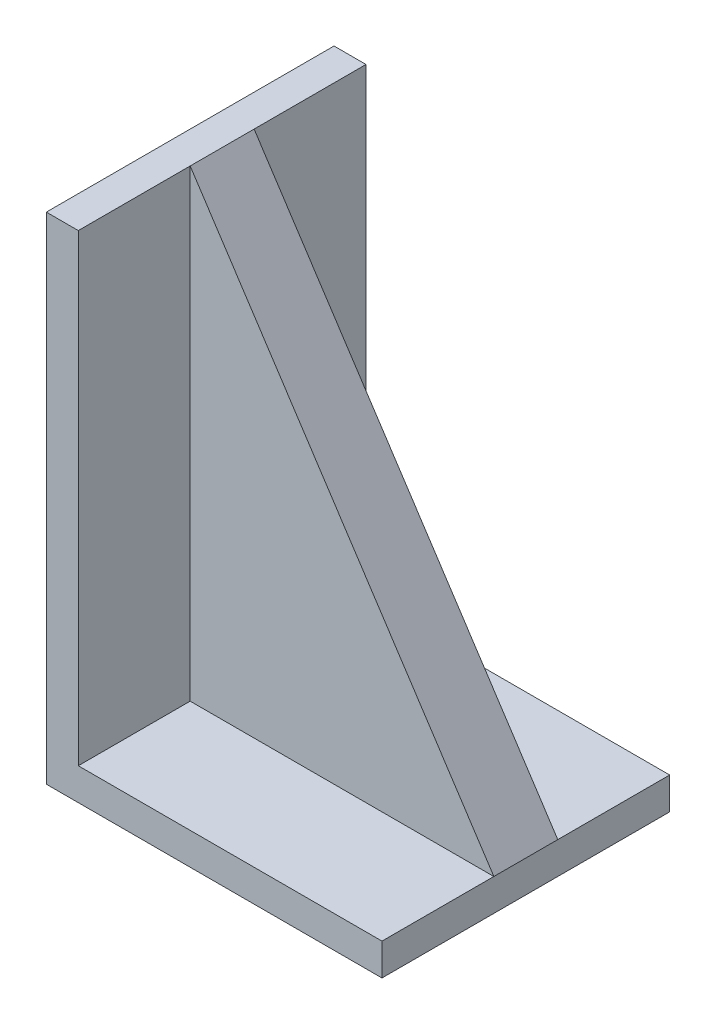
ISO-10303-21;
HEADER;
FILE_DESCRIPTION(('STEP AP214'),'2;1');
FILE_NAME('part.step','',(''),(''),'','','');
FILE_SCHEMA(('AUTOMOTIVE_DESIGN { 1 0 10303 214 1 1 1 1 }'));
ENDSEC;
DATA;
#1=APPLICATION_CONTEXT('core data for automotive mechanical design processes');
#2=APPLICATION_PROTOCOL_DEFINITION('international standard','automotive_design',2000,#1);
#3=PRODUCT_CONTEXT('',#1,'mechanical');
#4=PRODUCT('Part','Part','',(#3));
#5=PRODUCT_RELATED_PRODUCT_CATEGORY('part','',(#4));
#6=PRODUCT_DEFINITION_FORMATION('','',#4);
#7=PRODUCT_DEFINITION_CONTEXT('part definition',#1,'design');
#8=PRODUCT_DEFINITION('design','',#6,#7);
#9=PRODUCT_DEFINITION_SHAPE('','',#8);
#10=(LENGTH_UNIT() NAMED_UNIT(*) SI_UNIT(.MILLI.,.METRE.));
#11=(NAMED_UNIT(*) PLANE_ANGLE_UNIT() SI_UNIT($,.RADIAN.));
#12=(NAMED_UNIT(*) SI_UNIT($,.STERADIAN.) SOLID_ANGLE_UNIT());
#13=UNCERTAINTY_MEASURE_WITH_UNIT(LENGTH_MEASURE(1.E-05),#10,'distance_accuracy_value','');
#14=(GEOMETRIC_REPRESENTATION_CONTEXT(3) GLOBAL_UNCERTAINTY_ASSIGNED_CONTEXT((#13)) GLOBAL_UNIT_ASSIGNED_CONTEXT((#10,
#11,#12)) REPRESENTATION_CONTEXT('',''));
#15=CARTESIAN_POINT('',(0.,0.,0.));
#16=DIRECTION('',(0.,0.,1.));
#17=DIRECTION('',(1.,0.,0.));
#18=AXIS2_PLACEMENT_3D('',#15,#16,#17);
#19=CARTESIAN_POINT('',(0.,2.5,22.5));
#20=DIRECTION('',(0.,1.,0.));
#21=DIRECTION('',(0.,0.,1.));
#22=AXIS2_PLACEMENT_3D('',#19,#20,#21);
#23=PLANE('',#22);
#24=DIRECTION('',(0.,0.,-1.));
#25=VECTOR('',#24,1.);
#26=CARTESIAN_POINT('',(2.5,2.5,22.5));
#27=LINE('',#26,#25);
#28=CARTESIAN_POINT('',(2.5,2.5,-5.));
#29=VERTEX_POINT('',#28);
#30=CARTESIAN_POINT('',(2.5,2.5,-22.5));
#31=VERTEX_POINT('',#30);
#32=EDGE_CURVE('E126',#29,#31,#27,.T.);
#33=ORIENTED_EDGE('',*,*,#32,.F.);
#34=DIRECTION('',(1.,0.,0.));
#35=VECTOR('',#34,1.);
#36=CARTESIAN_POINT('',(0.,2.5,-5.));
#37=LINE('',#36,#35);
#38=CARTESIAN_POINT('',(50.,2.50000000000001,-5.));
#39=VERTEX_POINT('',#38);
#40=EDGE_CURVE('E116',#29,#39,#37,.T.);
#41=ORIENTED_EDGE('',*,*,#40,.T.);
#42=DIRECTION('',(0.,0.,-1.));
#43=VECTOR('',#42,1.);
#44=CARTESIAN_POINT('',(50.,2.5,22.5));
#45=LINE('',#44,#43);
#46=CARTESIAN_POINT('',(50.,2.5,-22.5));
#47=VERTEX_POINT('',#46);
#48=EDGE_CURVE('E124',#39,#47,#45,.T.);
#49=ORIENTED_EDGE('',*,*,#48,.T.);
#50=DIRECTION('',(1.,0.,0.));
#51=VECTOR('',#50,1.);
#52=CARTESIAN_POINT('',(0.,2.5,-22.5));
#53=LINE('',#52,#51);
#54=EDGE_CURVE('E170',#31,#47,#53,.T.);
#55=ORIENTED_EDGE('',*,*,#54,.F.);
#56=EDGE_LOOP('',(#33,#41,#49,#55));
#57=FACE_BOUND('',#56,.T.);
#58=ADVANCED_FACE('F33',(#57),#23,.T.);
#59=CARTESIAN_POINT('',(2.5,75.,22.5));
#60=DIRECTION('',(1.,0.,0.));
#61=DIRECTION('',(0.,1.,0.));
#62=AXIS2_PLACEMENT_3D('',#59,#60,#61);
#63=PLANE('',#62);
#64=DIRECTION('',(0.,0.,-1.));
#65=VECTOR('',#64,1.);
#66=CARTESIAN_POINT('',(2.5,75.,22.5));
#67=LINE('',#66,#65);
#68=CARTESIAN_POINT('',(2.5,75.,-4.99999999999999));
#69=VERTEX_POINT('',#68);
#70=CARTESIAN_POINT('',(2.5,75.,-22.5));
#71=VERTEX_POINT('',#70);
#72=EDGE_CURVE('E141',#69,#71,#67,.T.);
#73=ORIENTED_EDGE('',*,*,#72,.F.);
#74=DIRECTION('',(0.,-1.,0.));
#75=VECTOR('',#74,1.);
#76=CARTESIAN_POINT('',(2.5,75.,-5.));
#77=LINE('',#76,#75);
#78=EDGE_CURVE('E118',#69,#29,#77,.T.);
#79=ORIENTED_EDGE('',*,*,#78,.T.);
#80=ORIENTED_EDGE('',*,*,#32,.T.);
#81=DIRECTION('',(0.,-1.,0.));
#82=VECTOR('',#81,1.);
#83=CARTESIAN_POINT('',(2.5,75.,-22.5));
#84=LINE('',#83,#82);
#85=EDGE_CURVE('E167',#71,#31,#84,.T.);
#86=ORIENTED_EDGE('',*,*,#85,.F.);
#87=EDGE_LOOP('',(#73,#79,#80,#86));
#88=FACE_BOUND('',#87,.T.);
#89=ADVANCED_FACE('F179',(#88),#63,.T.);
#90=CARTESIAN_POINT('',(0.,-2.5,22.5));
#91=DIRECTION('',(0.,1.,0.));
#92=DIRECTION('',(0.,0.,1.));
#93=AXIS2_PLACEMENT_3D('',#90,#91,#92);
#94=PLANE('',#93);
#95=DIRECTION('',(0.,0.,-1.));
#96=VECTOR('',#95,1.);
#97=CARTESIAN_POINT('',(-2.5,-2.5,22.5));
#98=LINE('',#97,#96);
#99=CARTESIAN_POINT('',(-2.5,-2.5,22.5));
#100=VERTEX_POINT('',#99);
#101=CARTESIAN_POINT('',(-2.5,-2.5,-22.5));
#102=VERTEX_POINT('',#101);
#103=EDGE_CURVE('E144',#100,#102,#98,.T.);
#104=ORIENTED_EDGE('',*,*,#103,.T.);
#105=DIRECTION('',(1.,0.,0.));
#106=VECTOR('',#105,1.);
#107=CARTESIAN_POINT('',(0.,-2.5,-22.5));
#108=LINE('',#107,#106);
#109=CARTESIAN_POINT('',(50.,-2.5,-22.5));
#110=VERTEX_POINT('',#109);
#111=EDGE_CURVE('E110',#102,#110,#108,.T.);
#112=ORIENTED_EDGE('',*,*,#111,.T.);
#113=DIRECTION('',(0.,0.,-1.));
#114=VECTOR('',#113,1.);
#115=CARTESIAN_POINT('',(50.,-2.5,22.5));
#116=LINE('',#115,#114);
#117=CARTESIAN_POINT('',(50.,-2.5,22.5));
#118=VERTEX_POINT('',#117);
#119=EDGE_CURVE('E11',#118,#110,#116,.T.);
#120=ORIENTED_EDGE('',*,*,#119,.F.);
#121=DIRECTION('',(1.,0.,0.));
#122=VECTOR('',#121,1.);
#123=CARTESIAN_POINT('',(0.,-2.5,22.5));
#124=LINE('',#123,#122);
#125=EDGE_CURVE('E159',#100,#118,#124,.T.);
#126=ORIENTED_EDGE('',*,*,#125,.F.);
#127=EDGE_LOOP('',(#104,#112,#120,#126));
#128=FACE_BOUND('',#127,.T.);
#129=ADVANCED_FACE('F35',(#128),#94,.F.);
#130=CARTESIAN_POINT('',(50.,2.5,22.5));
#131=DIRECTION('',(1.,0.,0.));
#132=DIRECTION('',(0.,0.,-1.));
#133=AXIS2_PLACEMENT_3D('',#130,#131,#132);
#134=PLANE('',#133);
#135=ORIENTED_EDGE('',*,*,#119,.T.);
#136=DIRECTION('',(0.,-1.,0.));
#137=VECTOR('',#136,1.);
#138=CARTESIAN_POINT('',(50.,2.5,-22.5));
#139=LINE('',#138,#137);
#140=EDGE_CURVE('E131',#47,#110,#139,.T.);
#141=ORIENTED_EDGE('',*,*,#140,.F.);
#142=ORIENTED_EDGE('',*,*,#48,.F.);
#143=DIRECTION('',(0.,0.,1.));
#144=VECTOR('',#143,1.);
#145=CARTESIAN_POINT('',(50.,2.5,22.5));
#146=LINE('',#145,#144);
#147=CARTESIAN_POINT('',(50.,2.50000000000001,5.));
#148=VERTEX_POINT('',#147);
#149=EDGE_CURVE('E103',#148,#39,#146,.F.);
#150=ORIENTED_EDGE('',*,*,#149,.F.);
#151=CARTESIAN_POINT('',(50.,2.5,22.5));
#152=VERTEX_POINT('',#151);
#153=EDGE_CURVE('E41',#152,#148,#45,.T.);
#154=ORIENTED_EDGE('',*,*,#153,.F.);
#155=DIRECTION('',(0.,-1.,0.));
#156=VECTOR('',#155,1.);
#157=CARTESIAN_POINT('',(50.,2.5,22.5));
#158=LINE('',#157,#156);
#159=EDGE_CURVE('E156',#152,#118,#158,.T.);
#160=ORIENTED_EDGE('',*,*,#159,.T.);
#161=EDGE_LOOP('',(#135,#141,#142,#150,#154,#160));
#162=FACE_BOUND('',#161,.T.);
#163=ADVANCED_FACE('F129',(#162),#134,.T.);
#164=DIRECTION('',(1.,0.,0.));
#165=VECTOR('',#164,1.);
#166=CARTESIAN_POINT('',(0.,2.5,5.));
#167=LINE('',#166,#165);
#168=CARTESIAN_POINT('',(2.5,2.5,5.));
#169=VERTEX_POINT('',#168);
#170=EDGE_CURVE('E111',#169,#148,#167,.T.);
#171=ORIENTED_EDGE('',*,*,#170,.F.);
#172=CARTESIAN_POINT('',(2.5,2.5,22.5));
#173=VERTEX_POINT('',#172);
#174=EDGE_CURVE('E133',#173,#169,#27,.T.);
#175=ORIENTED_EDGE('',*,*,#174,.F.);
#176=DIRECTION('',(1.,0.,0.));
#177=VECTOR('',#176,1.);
#178=CARTESIAN_POINT('',(0.,2.5,22.5));
#179=LINE('',#178,#177);
#180=EDGE_CURVE('E153',#173,#152,#179,.T.);
#181=ORIENTED_EDGE('',*,*,#180,.T.);
#182=ORIENTED_EDGE('',*,*,#153,.T.);
#183=EDGE_LOOP('',(#171,#175,#181,#182));
#184=FACE_BOUND('',#183,.T.);
#185=ADVANCED_FACE('F194',(#184),#23,.T.);
#186=DIRECTION('',(0.,-1.,0.));
#187=VECTOR('',#186,1.);
#188=CARTESIAN_POINT('',(2.5,75.,5.));
#189=LINE('',#188,#187);
#190=CARTESIAN_POINT('',(2.5,75.,5.));
#191=VERTEX_POINT('',#190);
#192=EDGE_CURVE('E127',#191,#169,#189,.T.);
#193=ORIENTED_EDGE('',*,*,#192,.F.);
#194=CARTESIAN_POINT('',(2.5,75.,22.5));
#195=VERTEX_POINT('',#194);
#196=EDGE_CURVE('E137',#195,#191,#67,.T.);
#197=ORIENTED_EDGE('',*,*,#196,.F.);
#198=DIRECTION('',(0.,-1.,0.));
#199=VECTOR('',#198,1.);
#200=CARTESIAN_POINT('',(2.5,75.,22.5));
#201=LINE('',#200,#199);
#202=EDGE_CURVE('E150',#195,#173,#201,.T.);
#203=ORIENTED_EDGE('',*,*,#202,.T.);
#204=ORIENTED_EDGE('',*,*,#174,.T.);
#205=EDGE_LOOP('',(#193,#197,#203,#204));
#206=FACE_BOUND('',#205,.T.);
#207=ADVANCED_FACE('F190',(#206),#63,.T.);
#208=CARTESIAN_POINT('',(-2.5,75.,22.5));
#209=DIRECTION('',(0.,1.,0.));
#210=DIRECTION('',(0.,0.,1.));
#211=AXIS2_PLACEMENT_3D('',#208,#209,#210);
#212=PLANE('',#211);
#213=ORIENTED_EDGE('',*,*,#196,.T.);
#214=EDGE_CURVE('E140',#191,#69,#67,.T.);
#215=ORIENTED_EDGE('',*,*,#214,.T.);
#216=ORIENTED_EDGE('',*,*,#72,.T.);
#217=DIRECTION('',(1.,0.,0.));
#218=VECTOR('',#217,1.);
#219=CARTESIAN_POINT('',(-2.5,75.,-22.5));
#220=LINE('',#219,#218);
#221=CARTESIAN_POINT('',(-2.5,75.,-22.5));
#222=VERTEX_POINT('',#221);
#223=EDGE_CURVE('E164',#222,#71,#220,.T.);
#224=ORIENTED_EDGE('',*,*,#223,.F.);
#225=DIRECTION('',(0.,0.,-1.));
#226=VECTOR('',#225,1.);
#227=CARTESIAN_POINT('',(-2.5,75.,22.5));
#228=LINE('',#227,#226);
#229=CARTESIAN_POINT('',(-2.5,75.,22.5));
#230=VERTEX_POINT('',#229);
#231=EDGE_CURVE('E142',#230,#222,#228,.T.);
#232=ORIENTED_EDGE('',*,*,#231,.F.);
#233=DIRECTION('',(1.,0.,0.));
#234=VECTOR('',#233,1.);
#235=CARTESIAN_POINT('',(-2.5,75.,22.5));
#236=LINE('',#235,#234);
#237=EDGE_CURVE('E147',#230,#195,#236,.T.);
#238=ORIENTED_EDGE('',*,*,#237,.T.);
#239=EDGE_LOOP('',(#213,#215,#216,#224,#232,#238));
#240=FACE_BOUND('',#239,.T.);
#241=ADVANCED_FACE('F184',(#240),#212,.T.);
#242=CARTESIAN_POINT('',(-2.5,75.,22.5));
#243=DIRECTION('',(1.,0.,0.));
#244=DIRECTION('',(0.,1.,0.));
#245=AXIS2_PLACEMENT_3D('',#242,#243,#244);
#246=PLANE('',#245);
#247=ORIENTED_EDGE('',*,*,#231,.T.);
#248=DIRECTION('',(0.,-1.,0.));
#249=VECTOR('',#248,1.);
#250=CARTESIAN_POINT('',(-2.5,75.,-22.5));
#251=LINE('',#250,#249);
#252=EDGE_CURVE('E161',#222,#102,#251,.T.);
#253=ORIENTED_EDGE('',*,*,#252,.T.);
#254=ORIENTED_EDGE('',*,*,#103,.F.);
#255=DIRECTION('',(0.,-1.,0.));
#256=VECTOR('',#255,1.);
#257=CARTESIAN_POINT('',(-2.5,75.,22.5));
#258=LINE('',#257,#256);
#259=EDGE_CURVE('E56',#230,#100,#258,.T.);
#260=ORIENTED_EDGE('',*,*,#259,.F.);
#261=EDGE_LOOP('',(#247,#253,#254,#260));
#262=FACE_BOUND('',#261,.T.);
#263=ADVANCED_FACE('F205',(#262),#246,.F.);
#264=CARTESIAN_POINT('',(50.,-2.5,22.5));
#265=DIRECTION('',(0.,0.,-1.));
#266=DIRECTION('',(-1.,0.,0.));
#267=AXIS2_PLACEMENT_3D('',#264,#265,#266);
#268=PLANE('',#267);
#269=ORIENTED_EDGE('',*,*,#125,.T.);
#270=ORIENTED_EDGE('',*,*,#159,.F.);
#271=ORIENTED_EDGE('',*,*,#180,.F.);
#272=ORIENTED_EDGE('',*,*,#202,.F.);
#273=ORIENTED_EDGE('',*,*,#237,.F.);
#274=ORIENTED_EDGE('',*,*,#259,.T.);
#275=EDGE_LOOP('',(#269,#270,#271,#272,#273,#274));
#276=FACE_BOUND('',#275,.T.);
#277=ADVANCED_FACE('F196',(#276),#268,.F.);
#278=CARTESIAN_POINT('',(50.,-2.5,-22.5));
#279=DIRECTION('',(0.,0.,-1.));
#280=DIRECTION('',(-1.,0.,0.));
#281=AXIS2_PLACEMENT_3D('',#278,#279,#280);
#282=PLANE('',#281);
#283=ORIENTED_EDGE('',*,*,#111,.F.);
#284=ORIENTED_EDGE('',*,*,#252,.F.);
#285=ORIENTED_EDGE('',*,*,#223,.T.);
#286=ORIENTED_EDGE('',*,*,#85,.T.);
#287=ORIENTED_EDGE('',*,*,#54,.T.);
#288=ORIENTED_EDGE('',*,*,#140,.T.);
#289=EDGE_LOOP('',(#283,#284,#285,#286,#287,#288));
#290=FACE_BOUND('',#289,.T.);
#291=ADVANCED_FACE('F203',(#290),#282,.T.);
#292=CARTESIAN_POINT('',(2.5,75.,0.));
#293=DIRECTION('',(-0.836461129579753,-0.548026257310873,0.));
#294=DIRECTION('',(0.548026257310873,-0.836461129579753,0.));
#295=AXIS2_PLACEMENT_3D('',#292,#293,#294);
#296=PLANE('',#295);
#297=DIRECTION('',(0.548026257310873,-0.836461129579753,0.));
#298=VECTOR('',#297,1.);
#299=CARTESIAN_POINT('',(2.5,75.,5.));
#300=LINE('',#299,#298);
#301=EDGE_CURVE('E106',#191,#148,#300,.T.);
#302=ORIENTED_EDGE('',*,*,#301,.T.);
#303=ORIENTED_EDGE('',*,*,#149,.T.);
#304=DIRECTION('',(0.548026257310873,-0.836461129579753,0.));
#305=VECTOR('',#304,1.);
#306=CARTESIAN_POINT('',(2.5,75.,-5.));
#307=LINE('',#306,#305);
#308=EDGE_CURVE('E48',#69,#39,#307,.T.);
#309=ORIENTED_EDGE('',*,*,#308,.F.);
#310=ORIENTED_EDGE('',*,*,#214,.F.);
#311=EDGE_LOOP('',(#302,#303,#309,#310));
#312=FACE_BOUND('',#311,.T.);
#313=ADVANCED_FACE('F104',(#312),#296,.F.);
#314=CARTESIAN_POINT('',(23.75,36.25,5.));
#315=DIRECTION('',(0.,0.,1.));
#316=DIRECTION('',(1.,0.,0.));
#317=AXIS2_PLACEMENT_3D('',#314,#315,#316);
#318=PLANE('',#317);
#319=ORIENTED_EDGE('',*,*,#192,.T.);
#320=ORIENTED_EDGE('',*,*,#170,.T.);
#321=ORIENTED_EDGE('',*,*,#301,.F.);
#322=EDGE_LOOP('',(#319,#320,#321));
#323=FACE_BOUND('',#322,.T.);
#324=ADVANCED_FACE('F187',(#323),#318,.T.);
#325=CARTESIAN_POINT('',(23.75,36.25,-5.));
#326=DIRECTION('',(0.,0.,1.));
#327=DIRECTION('',(1.,0.,0.));
#328=AXIS2_PLACEMENT_3D('',#325,#326,#327);
#329=PLANE('',#328);
#330=ORIENTED_EDGE('',*,*,#40,.F.);
#331=ORIENTED_EDGE('',*,*,#78,.F.);
#332=ORIENTED_EDGE('',*,*,#308,.T.);
#333=EDGE_LOOP('',(#330,#331,#332));
#334=FACE_BOUND('',#333,.T.);
#335=ADVANCED_FACE('F115',(#334),#329,.F.);
#336=CLOSED_SHELL('',(#58,#89,#129,#163,#185,#207,#241,#263,#277,#291,#313,#324,#335));
#337=MANIFOLD_SOLID_BREP('B2',#336);
#338=ADVANCED_BREP_SHAPE_REPRESENTATION('',(#18,#337),#14);
#339=SHAPE_DEFINITION_REPRESENTATION(#9,#338);
ENDSEC;
END-ISO-10303-21;
